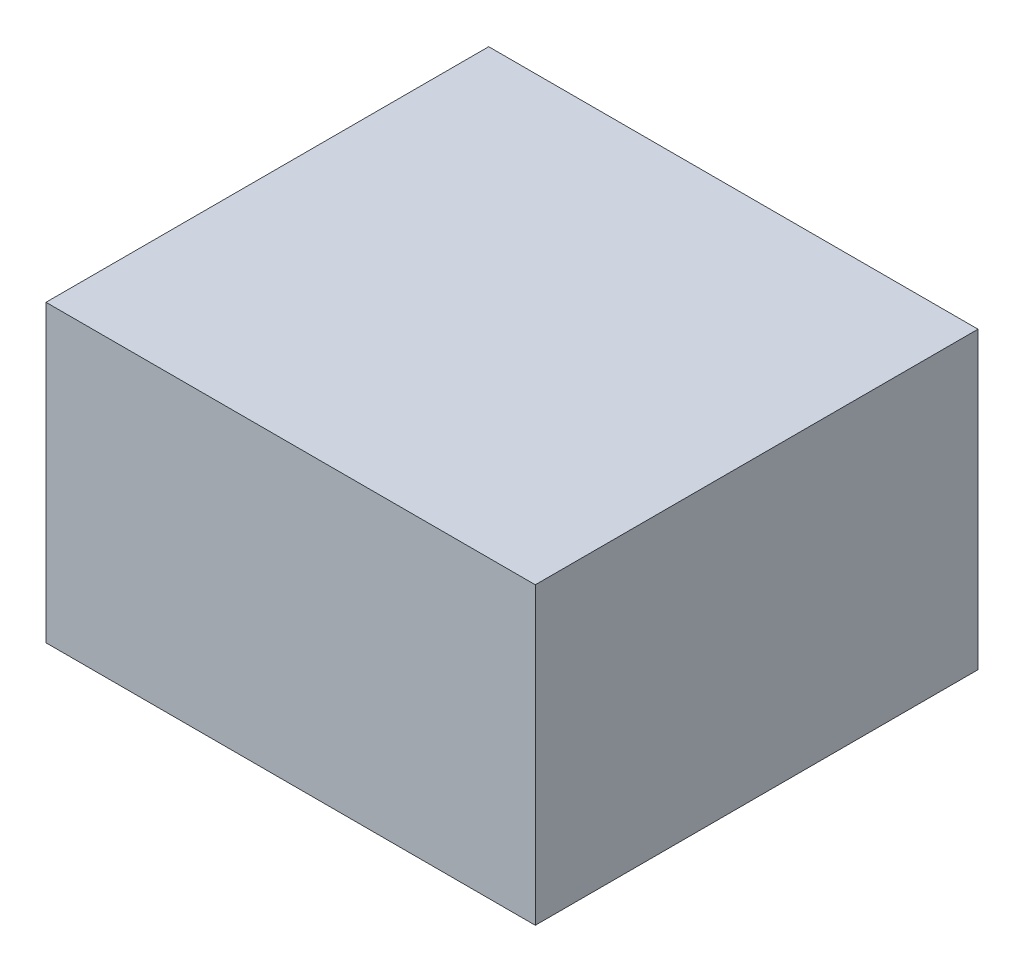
ISO-10303-21;
HEADER;
FILE_DESCRIPTION(('STEP AP214'),'2;1');
FILE_NAME('part.step','',(''),(''),'','','');
FILE_SCHEMA(('AUTOMOTIVE_DESIGN { 1 0 10303 214 1 1 1 1 }'));
ENDSEC;
DATA;
#1=APPLICATION_CONTEXT('core data for automotive mechanical design processes');
#2=APPLICATION_PROTOCOL_DEFINITION('international standard','automotive_design',2000,#1);
#3=PRODUCT_CONTEXT('',#1,'mechanical');
#4=PRODUCT('Part','Part','',(#3));
#5=PRODUCT_RELATED_PRODUCT_CATEGORY('part','',(#4));
#6=PRODUCT_DEFINITION_FORMATION('','',#4);
#7=PRODUCT_DEFINITION_CONTEXT('part definition',#1,'design');
#8=PRODUCT_DEFINITION('design','',#6,#7);
#9=PRODUCT_DEFINITION_SHAPE('','',#8);
#10=(LENGTH_UNIT() NAMED_UNIT(*) SI_UNIT(.MILLI.,.METRE.));
#11=(NAMED_UNIT(*) PLANE_ANGLE_UNIT() SI_UNIT($,.RADIAN.));
#12=(NAMED_UNIT(*) SI_UNIT($,.STERADIAN.) SOLID_ANGLE_UNIT());
#13=UNCERTAINTY_MEASURE_WITH_UNIT(LENGTH_MEASURE(1.E-05),#10,'distance_accuracy_value','');
#14=(GEOMETRIC_REPRESENTATION_CONTEXT(3) GLOBAL_UNCERTAINTY_ASSIGNED_CONTEXT((#13)) GLOBAL_UNIT_ASSIGNED_CONTEXT((#10,
#11,#12)) REPRESENTATION_CONTEXT('',''));
#15=CARTESIAN_POINT('',(0.,0.,0.));
#16=DIRECTION('',(0.,0.,1.));
#17=DIRECTION('',(1.,0.,0.));
#18=AXIS2_PLACEMENT_3D('',#15,#16,#17);
#19=CARTESIAN_POINT('',(-20.1436183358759,-74.4320712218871,21.8817366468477));
#20=DIRECTION('',(1.,0.,0.));
#21=DIRECTION('',(0.,0.,-1.));
#22=AXIS2_PLACEMENT_3D('',#19,#20,#21);
#23=PLANE('',#22);
#24=DIRECTION('',(0.,0.,-1.));
#25=VECTOR('',#24,1.);
#26=CARTESIAN_POINT('',(-20.1436183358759,-44.4320712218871,21.8817366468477));
#27=LINE('',#26,#25);
#28=CARTESIAN_POINT('',(-20.1436183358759,-44.4320712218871,21.8817366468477));
#29=VERTEX_POINT('',#28);
#30=CARTESIAN_POINT('',(-20.1436183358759,-44.4320712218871,-23.1514699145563));
#31=VERTEX_POINT('',#30);
#32=EDGE_CURVE('E124',#29,#31,#27,.T.);
#33=ORIENTED_EDGE('',*,*,#32,.T.);
#34=DIRECTION('',(0.,1.,0.));
#35=VECTOR('',#34,1.);
#36=CARTESIAN_POINT('',(-20.1436183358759,-74.4320712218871,-23.1514699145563));
#37=LINE('',#36,#35);
#38=CARTESIAN_POINT('',(-20.1436183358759,-74.4320712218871,-23.1514699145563));
#39=VERTEX_POINT('',#38);
#40=EDGE_CURVE('E13',#39,#31,#37,.T.);
#41=ORIENTED_EDGE('',*,*,#40,.F.);
#42=DIRECTION('',(0.,0.,-1.));
#43=VECTOR('',#42,1.);
#44=CARTESIAN_POINT('',(-20.1436183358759,-74.4320712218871,21.8817366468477));
#45=LINE('',#44,#43);
#46=CARTESIAN_POINT('',(-20.1436183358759,-74.4320712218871,21.8817366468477));
#47=VERTEX_POINT('',#46);
#48=EDGE_CURVE('E192',#47,#39,#45,.T.);
#49=ORIENTED_EDGE('',*,*,#48,.F.);
#50=DIRECTION('',(0.,1.,0.));
#51=VECTOR('',#50,1.);
#52=CARTESIAN_POINT('',(-20.1436183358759,-74.4320712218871,21.8817366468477));
#53=LINE('',#52,#51);
#54=EDGE_CURVE('E195',#47,#29,#53,.T.);
#55=ORIENTED_EDGE('',*,*,#54,.T.);
#56=EDGE_LOOP('',(#33,#41,#49,#55));
#57=FACE_BOUND('',#56,.T.);
#58=ADVANCED_FACE('F68',(#57),#23,.F.);
#59=CARTESIAN_POINT('',(-20.1436183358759,-74.4320712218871,-23.1514699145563));
#60=DIRECTION('',(0.,0.,1.));
#61=DIRECTION('',(1.,0.,0.));
#62=AXIS2_PLACEMENT_3D('',#59,#60,#61);
#63=PLANE('',#62);
#64=DIRECTION('',(1.,0.,0.));
#65=VECTOR('',#64,1.);
#66=CARTESIAN_POINT('',(-20.1436183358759,-44.4320712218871,-23.1514699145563));
#67=LINE('',#66,#65);
#68=CARTESIAN_POINT('',(29.6299257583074,-44.4320712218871,-23.1514699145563));
#69=VERTEX_POINT('',#68);
#70=EDGE_CURVE('E131',#31,#69,#67,.T.);
#71=ORIENTED_EDGE('',*,*,#70,.T.);
#72=DIRECTION('',(0.,1.,0.));
#73=VECTOR('',#72,1.);
#74=CARTESIAN_POINT('',(29.6299257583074,-74.4320712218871,-23.1514699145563));
#75=LINE('',#74,#73);
#76=CARTESIAN_POINT('',(29.6299257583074,-74.4320712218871,-23.1514699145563));
#77=VERTEX_POINT('',#76);
#78=EDGE_CURVE('E76',#77,#69,#75,.T.);
#79=ORIENTED_EDGE('',*,*,#78,.F.);
#80=DIRECTION('',(1.,0.,0.));
#81=VECTOR('',#80,1.);
#82=CARTESIAN_POINT('',(-20.1436183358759,-74.4320712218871,-23.1514699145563));
#83=LINE('',#82,#81);
#84=EDGE_CURVE('E115',#39,#77,#83,.T.);
#85=ORIENTED_EDGE('',*,*,#84,.F.);
#86=ORIENTED_EDGE('',*,*,#40,.T.);
#87=EDGE_LOOP('',(#71,#79,#85,#86));
#88=FACE_BOUND('',#87,.T.);
#89=ADVANCED_FACE('F179',(#88),#63,.F.);
#90=CARTESIAN_POINT('',(29.6299257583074,-74.4320712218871,21.8817366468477));
#91=DIRECTION('',(-1.,0.,0.));
#92=DIRECTION('',(0.,0.,1.));
#93=AXIS2_PLACEMENT_3D('',#90,#91,#92);
#94=PLANE('',#93);
#95=DIRECTION('',(0.,0.,1.));
#96=VECTOR('',#95,1.);
#97=CARTESIAN_POINT('',(29.6299257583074,-44.4320712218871,21.8817366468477));
#98=LINE('',#97,#96);
#99=CARTESIAN_POINT('',(29.6299257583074,-44.4320712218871,21.8817366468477));
#100=VERTEX_POINT('',#99);
#101=EDGE_CURVE('E102',#69,#100,#98,.T.);
#102=ORIENTED_EDGE('',*,*,#101,.T.);
#103=DIRECTION('',(0.,1.,0.));
#104=VECTOR('',#103,1.);
#105=CARTESIAN_POINT('',(29.6299257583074,-74.4320712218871,21.8817366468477));
#106=LINE('',#105,#104);
#107=CARTESIAN_POINT('',(29.6299257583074,-74.4320712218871,21.8817366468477));
#108=VERTEX_POINT('',#107);
#109=EDGE_CURVE('E190',#108,#100,#106,.T.);
#110=ORIENTED_EDGE('',*,*,#109,.F.);
#111=DIRECTION('',(0.,0.,1.));
#112=VECTOR('',#111,1.);
#113=CARTESIAN_POINT('',(29.6299257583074,-74.4320712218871,21.8817366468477));
#114=LINE('',#113,#112);
#115=EDGE_CURVE('E189',#77,#108,#114,.T.);
#116=ORIENTED_EDGE('',*,*,#115,.F.);
#117=ORIENTED_EDGE('',*,*,#78,.T.);
#118=EDGE_LOOP('',(#102,#110,#116,#117));
#119=FACE_BOUND('',#118,.T.);
#120=ADVANCED_FACE('F177',(#119),#94,.F.);
#121=CARTESIAN_POINT('',(-20.1436183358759,-74.4320712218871,21.8817366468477));
#122=DIRECTION('',(0.,0.,-1.));
#123=DIRECTION('',(-1.,0.,0.));
#124=AXIS2_PLACEMENT_3D('',#121,#122,#123);
#125=PLANE('',#124);
#126=DIRECTION('',(-1.,0.,0.));
#127=VECTOR('',#126,1.);
#128=CARTESIAN_POINT('',(-20.1436183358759,-44.4320712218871,21.8817366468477));
#129=LINE('',#128,#127);
#130=EDGE_CURVE('E108',#100,#29,#129,.T.);
#131=ORIENTED_EDGE('',*,*,#130,.T.);
#132=ORIENTED_EDGE('',*,*,#54,.F.);
#133=DIRECTION('',(-1.,0.,0.));
#134=VECTOR('',#133,1.);
#135=CARTESIAN_POINT('',(-20.1436183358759,-74.4320712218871,21.8817366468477));
#136=LINE('',#135,#134);
#137=EDGE_CURVE('E84',#108,#47,#136,.T.);
#138=ORIENTED_EDGE('',*,*,#137,.F.);
#139=ORIENTED_EDGE('',*,*,#109,.T.);
#140=EDGE_LOOP('',(#131,#132,#138,#139));
#141=FACE_BOUND('',#140,.T.);
#142=ADVANCED_FACE('F170',(#141),#125,.F.);
#143=CARTESIAN_POINT('',(0.,-74.4320712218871,0.));
#144=DIRECTION('',(0.,-1.,0.));
#145=DIRECTION('',(0.,0.,-1.));
#146=AXIS2_PLACEMENT_3D('',#143,#144,#145);
#147=PLANE('',#146);
#148=CARTESIAN_POINT('',(4.98263771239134,-74.4320712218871,-0.75199819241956));
#149=DIRECTION('',(0.,1.,0.));
#150=DIRECTION('',(0.,0.,1.));
#151=AXIS2_PLACEMENT_3D('',#148,#149,#150);
#152=CIRCLE('',#151,20.);
#153=CARTESIAN_POINT('',(4.98263771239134,-74.4320712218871,19.2480018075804));
#154=VERTEX_POINT('',#153);
#155=EDGE_CURVE('E140',#154,#154,#152,.T.);
#156=ORIENTED_EDGE('',*,*,#155,.T.);
#157=EDGE_LOOP('',(#156));
#158=FACE_BOUND('',#157,.T.);
#159=ORIENTED_EDGE('',*,*,#48,.T.);
#160=ORIENTED_EDGE('',*,*,#84,.T.);
#161=ORIENTED_EDGE('',*,*,#115,.T.);
#162=ORIENTED_EDGE('',*,*,#137,.T.);
#163=EDGE_LOOP('',(#159,#160,#161,#162));
#164=FACE_BOUND('',#163,.T.);
#165=ADVANCED_FACE('F167',(#158,#164),#147,.T.);
#166=CARTESIAN_POINT('',(0.,-44.4320712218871,0.));
#167=DIRECTION('',(0.,-1.,0.));
#168=DIRECTION('',(0.,0.,-1.));
#169=AXIS2_PLACEMENT_3D('',#166,#167,#168);
#170=PLANE('',#169);
#171=ORIENTED_EDGE('',*,*,#32,.F.);
#172=ORIENTED_EDGE('',*,*,#130,.F.);
#173=ORIENTED_EDGE('',*,*,#101,.F.);
#174=ORIENTED_EDGE('',*,*,#70,.F.);
#175=EDGE_LOOP('',(#171,#172,#173,#174));
#176=FACE_BOUND('',#175,.T.);
#177=ADVANCED_FACE('F165',(#176),#170,.F.);
#178=CARTESIAN_POINT('',(4.98263771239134,-74.4320712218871,-0.75199819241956));
#179=DIRECTION('',(0.,1.,0.));
#180=DIRECTION('',(0.,0.,1.));
#181=AXIS2_PLACEMENT_3D('',#178,#179,#180);
#182=CYLINDRICAL_SURFACE('',#181,20.);
#183=ORIENTED_EDGE('',*,*,#155,.F.);
#184=EDGE_LOOP('',(#183));
#185=FACE_BOUND('',#184,.T.);
#186=CARTESIAN_POINT('',(4.98263771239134,-64.4320712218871,-0.75199819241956));
#187=DIRECTION('',(0.,1.,0.));
#188=DIRECTION('',(0.,0.,1.));
#189=AXIS2_PLACEMENT_3D('',#186,#187,#188);
#190=CIRCLE('',#189,20.);
#191=CARTESIAN_POINT('',(4.98263771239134,-64.4320712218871,19.2480018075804));
#192=VERTEX_POINT('',#191);
#193=EDGE_CURVE('E202',#192,#192,#190,.F.);
#194=ORIENTED_EDGE('',*,*,#193,.F.);
#195=EDGE_LOOP('',(#194));
#196=FACE_BOUND('',#195,.T.);
#197=ADVANCED_FACE('F158',(#185,#196),#182,.F.);
#198=CARTESIAN_POINT('',(4.98263771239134,-64.8820712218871,-0.75199819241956));
#199=DIRECTION('',(0.,-1.,0.));
#200=DIRECTION('',(-1.,0.,0.));
#201=AXIS2_PLACEMENT_3D('',#198,#199,#200);
#202=SPHERICAL_SURFACE('',#201,10.58);
#203=CARTESIAN_POINT('',(4.98263771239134,-61.4320712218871,-0.75199819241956));
#204=DIRECTION('',(0.,-1.,0.));
#205=DIRECTION('',(0.,0.,-1.));
#206=AXIS2_PLACEMENT_3D('',#203,#204,#205);
#207=CIRCLE('',#206,10.0016948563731);
#208=CARTESIAN_POINT('',(4.98263771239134,-61.4320712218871,-10.7536930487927));
#209=VERTEX_POINT('',#208);
#210=EDGE_CURVE('E134',#209,#209,#207,.T.);
#211=ORIENTED_EDGE('',*,*,#210,.T.);
#212=EDGE_LOOP('',(#211));
#213=FACE_BOUND('',#212,.T.);
#214=ADVANCED_FACE('F154',(#213),#202,.F.);
#215=CARTESIAN_POINT('',(4.98263771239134,-61.4320712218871,-0.75199819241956));
#216=DIRECTION('',(0.,1.,0.));
#217=DIRECTION('',(0.,0.,1.));
#218=AXIS2_PLACEMENT_3D('',#215,#216,#217);
#219=CONICAL_SURFACE('',#218,10.0016948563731,0.000564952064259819);
#220=CARTESIAN_POINT('',(4.98263771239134,-64.4320712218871,-0.75199819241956));
#221=DIRECTION('',(0.,-1.,0.));
#222=DIRECTION('',(0.,0.,-1.));
#223=AXIS2_PLACEMENT_3D('',#220,#221,#222);
#224=CIRCLE('',#223,10.);
#225=CARTESIAN_POINT('',(4.98263771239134,-64.4320712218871,-10.7519981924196));
#226=VERTEX_POINT('',#225);
#227=EDGE_CURVE('E125',#226,#226,#224,.T.);
#228=ORIENTED_EDGE('',*,*,#227,.T.);
#229=EDGE_LOOP('',(#228));
#230=FACE_BOUND('',#229,.T.);
#231=ORIENTED_EDGE('',*,*,#210,.F.);
#232=EDGE_LOOP('',(#231));
#233=FACE_BOUND('',#232,.T.);
#234=ADVANCED_FACE('F151',(#230,#233),#219,.F.);
#235=CARTESIAN_POINT('',(14.9826377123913,-64.4320712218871,-0.75199819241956));
#236=DIRECTION('',(0.,-1.,0.));
#237=DIRECTION('',(0.,0.,-1.));
#238=AXIS2_PLACEMENT_3D('',#235,#236,#237);
#239=PLANE('',#238);
#240=CARTESIAN_POINT('',(4.98263771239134,-64.4320712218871,-15.7519981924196));
#241=CARTESIAN_POINT('',(5.23015977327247,-64.4320712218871,-15.7520172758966));
#242=CARTESIAN_POINT('',(5.47769463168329,-64.4320712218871,-15.7461041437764));
#243=CARTESIAN_POINT('',(5.97039914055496,-64.4320712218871,-15.7222967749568));
#244=CARTESIAN_POINT('',(6.2155729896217,-64.4320712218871,-15.7044890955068));
#245=CARTESIAN_POINT('',(6.70355866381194,-64.4320712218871,-15.6568972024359));
#246=CARTESIAN_POINT('',(6.94637617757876,-64.4320712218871,-15.6271715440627));
#247=CARTESIAN_POINT('',(7.42964622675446,-64.4320712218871,-15.5557786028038));
#248=CARTESIAN_POINT('',(7.67010307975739,-64.4320712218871,-15.5141405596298));
#249=CARTESIAN_POINT('',(8.14865421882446,-64.4320712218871,-15.4189509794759));
#250=CARTESIAN_POINT('',(8.3867484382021,-64.4320712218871,-15.3653991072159));
#251=CARTESIAN_POINT('',(8.86057906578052,-64.4320712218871,-15.2464122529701));
#252=CARTESIAN_POINT('',(9.09630810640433,-64.4320712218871,-15.1809479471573));
#253=CARTESIAN_POINT('',(9.56541643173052,-64.4320712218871,-15.0381642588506));
#254=CARTESIAN_POINT('',(9.79877839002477,-64.4320712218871,-14.9607879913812));
#255=CARTESIAN_POINT('',(10.2631622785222,-64.4320712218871,-14.7942102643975));
#256=CARTESIAN_POINT('',(10.494154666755,-64.4320712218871,-14.7049265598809));
#257=CARTESIAN_POINT('',(10.9515588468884,-64.4320712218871,-14.515482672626));
#258=CARTESIAN_POINT('',(11.1779719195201,-64.4320712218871,-14.4153255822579));
#259=CARTESIAN_POINT('',(11.6240318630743,-64.4320712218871,-14.2048220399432));
#260=CARTESIAN_POINT('',(11.8437156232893,-64.4320712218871,-14.0945538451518));
#261=CARTESIAN_POINT('',(12.2763230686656,-64.4320712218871,-13.8638572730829));
#262=CARTESIAN_POINT('',(12.4892742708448,-64.4320712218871,-13.7434805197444));
#263=CARTESIAN_POINT('',(12.9084268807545,-64.4320712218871,-13.4925933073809));
#264=CARTESIAN_POINT('',(13.1146432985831,-64.4320712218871,-13.3621079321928));
#265=CARTESIAN_POINT('',(13.5203394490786,-64.4320712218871,-13.0910303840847));
#266=CARTESIAN_POINT('',(13.7198188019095,-64.4320712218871,-12.9504376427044));
#267=CARTESIAN_POINT('',(14.1120568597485,-64.4320712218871,-12.6591711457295));
#268=CARTESIAN_POINT('',(14.3047973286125,-64.4320712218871,-12.5084728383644));
#269=CARTESIAN_POINT('',(14.6835757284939,-64.4320712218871,-12.1970180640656));
#270=CARTESIAN_POINT('',(14.8695756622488,-64.4320712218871,-12.0362154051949));
#271=CARTESIAN_POINT('',(15.2348937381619,-64.4320712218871,-11.7045760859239));
#272=CARTESIAN_POINT('',(15.4141528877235,-64.4320712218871,-11.5336744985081));
#273=CARTESIAN_POINT('',(15.7642589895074,-64.4320712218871,-11.1835923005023));
#274=CARTESIAN_POINT('',(15.9351091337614,-64.4320712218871,-11.0044148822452));
#275=CARTESIAN_POINT('',(16.2666587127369,-64.4320712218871,-10.6392353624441));
#276=CARTESIAN_POINT('',(16.4274221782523,-64.4320712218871,-10.453291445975));
#277=CARTESIAN_POINT('',(16.7388155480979,-64.4320712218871,-10.0746038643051));
#278=CARTESIAN_POINT('',(16.8894906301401,-64.4320712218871,-9.88189736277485));
#279=CARTESIAN_POINT('',(17.1807267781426,-64.4320712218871,-9.48970505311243));
#280=CARTESIAN_POINT('',(17.3213113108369,-64.4320712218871,-9.29023667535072));
#281=CARTESIAN_POINT('',(17.5923887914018,-64.4320712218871,-8.88454047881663));
#282=CARTESIAN_POINT('',(17.7228811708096,-64.4320712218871,-8.6783122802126));
#283=CARTESIAN_POINT('',(17.973799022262,-64.4320712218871,-8.2591141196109));
#284=CARTESIAN_POINT('',(18.0941982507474,-64.4320712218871,-8.04612845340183));
#285=CARTESIAN_POINT('',(18.3249552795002,-64.4320712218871,-7.61342954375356));
#286=CARTESIAN_POINT('',(18.4352602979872,-64.4320712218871,-7.39368816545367));
#287=CARTESIAN_POINT('',(18.6458573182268,-64.4320712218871,-6.94749221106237));
#288=CARTESIAN_POINT('',(18.7460699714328,-64.4320712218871,-6.72100022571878));
#289=CARTESIAN_POINT('',(18.9355551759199,-64.4320712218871,-6.26358664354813));
#290=CARTESIAN_POINT('',(19.0248318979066,-64.4320712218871,-6.03266677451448));
#291=CARTESIAN_POINT('',(19.191395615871,-64.4320712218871,-5.56840635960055));
#292=CARTESIAN_POINT('',(19.2687640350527,-64.4320712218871,-5.33509506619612));
#293=CARTESIAN_POINT('',(19.4115365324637,-64.4320712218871,-4.86606827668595));
#294=CARTESIAN_POINT('',(19.4769965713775,-64.4320712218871,-4.63036982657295));
#295=CARTESIAN_POINT('',(19.5959781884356,-64.4320712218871,-4.15658013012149));
#296=CARTESIAN_POINT('',(19.6495281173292,-64.4320712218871,-3.91849600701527));
#297=CARTESIAN_POINT('',(19.7447178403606,-64.4320712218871,-3.43994473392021));
#298=CARTESIAN_POINT('',(19.786356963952,-64.4320712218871,-3.19947745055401));
#299=CARTESIAN_POINT('',(19.8577546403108,-64.4320712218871,-2.71616674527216));
#300=CARTESIAN_POINT('',(19.8874829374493,-64.4320712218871,-2.47331885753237));
#301=CARTESIAN_POINT('',(19.9350879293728,-64.4320712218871,-1.98525029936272));
#302=CARTESIAN_POINT('',(19.9529050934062,-64.4320712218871,-1.74002383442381));
#303=CARTESIAN_POINT('',(19.9767195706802,-64.4320712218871,-1.24720053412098));
#304=CARTESIAN_POINT('',(19.982629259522,-64.4320712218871,-0.999599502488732));
#305=CARTESIAN_POINT('',(19.9826461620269,-64.4320712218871,-0.504491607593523));
#306=CARTESIAN_POINT('',(19.9767578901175,-64.4320712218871,-0.256984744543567));
#307=CARTESIAN_POINT('',(19.952977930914,-64.4320712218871,0.23567712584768));
#308=CARTESIAN_POINT('',(19.9351726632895,-64.4320712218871,0.480836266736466));
#309=CARTESIAN_POINT('',(19.8875884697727,-64.4320712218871,0.968797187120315));
#310=CARTESIAN_POINT('',(19.8578677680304,-64.4320712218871,1.21160463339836));
#311=CARTESIAN_POINT('',(19.7864809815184,-64.4320712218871,1.6948615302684));
#312=CARTESIAN_POINT('',(19.7448438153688,-64.4320712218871,1.93531524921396));
#313=CARTESIAN_POINT('',(19.6496540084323,-64.4320712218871,2.41386650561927));
#314=CARTESIAN_POINT('',(19.5961006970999,-64.4320712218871,2.65196390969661));
#315=CARTESIAN_POINT('',(19.4771085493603,-64.4320712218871,3.1258074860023));
#316=CARTESIAN_POINT('',(19.4116400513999,-64.4320712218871,3.36154620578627));
#317=CARTESIAN_POINT('',(19.268845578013,-64.4320712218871,3.8306803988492));
#318=CARTESIAN_POINT('',(19.1914623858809,-64.4320712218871,4.06405844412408));
#319=CARTESIAN_POINT('',(19.0248687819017,-64.4320712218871,4.52848121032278));
#320=CARTESIAN_POINT('',(18.9355758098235,-64.4320712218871,4.75949627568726));
#321=CARTESIAN_POINT('',(18.7461218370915,-64.4320712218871,5.21692279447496));
#322=CARTESIAN_POINT('',(18.6459650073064,-64.4320712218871,5.443335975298));
#323=CARTESIAN_POINT('',(18.4354616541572,-64.4320712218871,5.88939599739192));
#324=CARTESIAN_POINT('',(18.3251933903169,-64.4320712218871,6.10907972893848));
#325=CARTESIAN_POINT('',(18.0944967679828,-64.4320712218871,6.54168715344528));
#326=CARTESIAN_POINT('',(17.9741200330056,-64.4320712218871,6.75463836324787));
#327=CARTESIAN_POINT('',(17.723232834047,-64.4320712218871,7.17379097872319));
#328=CARTESIAN_POINT('',(17.5927474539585,-64.4320712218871,7.38000739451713));
#329=CARTESIAN_POINT('',(17.3216699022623,-64.4320712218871,7.78570354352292));
#330=CARTESIAN_POINT('',(17.1810771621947,-64.4320712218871,7.98518289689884));
#331=CARTESIAN_POINT('',(16.8898106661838,-64.4320712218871,8.37742095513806));
#332=CARTESIAN_POINT('',(16.7391123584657,-64.4320712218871,8.57016142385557));
#333=CARTESIAN_POINT('',(16.4276575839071,-64.4320712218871,8.94893982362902));
#334=CARTESIAN_POINT('',(16.2668549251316,-64.4320712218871,9.13493975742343));
#335=CARTESIAN_POINT('',(15.9352156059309,-64.4320712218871,9.50025783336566));
#336=CARTESIAN_POINT('',(15.7643140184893,-64.4320712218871,9.67951698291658));
#337=CARTESIAN_POINT('',(15.414231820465,-64.4320712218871,10.0296230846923));
#338=CARTESIAN_POINT('',(15.2350544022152,-64.4320712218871,10.2004732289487));
#339=CARTESIAN_POINT('',(14.8698748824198,-64.4320712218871,10.5320228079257));
#340=CARTESIAN_POINT('',(14.6839309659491,-64.4320712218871,10.6927862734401));
#341=CARTESIAN_POINT('',(14.3052433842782,-64.4320712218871,11.0041796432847));
#342=CARTESIAN_POINT('',(14.1125368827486,-64.4320712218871,11.154854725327));
#343=CARTESIAN_POINT('',(13.7203445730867,-64.4320712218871,11.4460908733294));
#344=CARTESIAN_POINT('',(13.520876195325,-64.4320712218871,11.5866754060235));
#345=CARTESIAN_POINT('',(13.1151799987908,-64.4320712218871,11.8577528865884));
#346=CARTESIAN_POINT('',(12.9089518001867,-64.4320712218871,11.9882452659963));
#347=CARTESIAN_POINT('',(12.4897536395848,-64.4320712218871,12.239163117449));
#348=CARTESIAN_POINT('',(12.2767679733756,-64.4320712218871,12.3595623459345));
#349=CARTESIAN_POINT('',(11.8440690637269,-64.4320712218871,12.5903193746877));
#350=CARTESIAN_POINT('',(11.6243276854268,-64.4320712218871,12.700624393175));
#351=CARTESIAN_POINT('',(11.1781317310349,-64.4320712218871,12.9112214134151));
#352=CARTESIAN_POINT('',(10.9516397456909,-64.4320712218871,13.0114340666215));
#353=CARTESIAN_POINT('',(10.4942261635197,-64.4320712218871,13.2009192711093));
#354=CARTESIAN_POINT('',(10.2633062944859,-64.4320712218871,13.2901959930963));
#355=CARTESIAN_POINT('',(9.79904587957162,-64.4320712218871,13.4567597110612));
#356=CARTESIAN_POINT('',(9.56573458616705,-64.4320712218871,13.5341281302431));
#357=CARTESIAN_POINT('',(9.09670779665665,-64.4320712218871,13.6769006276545));
#358=CARTESIAN_POINT('',(8.86100934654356,-64.4320712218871,13.7423606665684));
#359=CARTESIAN_POINT('',(8.387219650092,-64.4320712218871,13.8613422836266));
#360=CARTESIAN_POINT('',(8.14913552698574,-64.4320712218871,13.9148922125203));
#361=CARTESIAN_POINT('',(7.67058425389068,-64.4320712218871,14.0100819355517));
#362=CARTESIAN_POINT('',(7.43011697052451,-64.4320712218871,14.0517210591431));
#363=CARTESIAN_POINT('',(6.94680626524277,-64.4320712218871,14.1231187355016));
#364=CARTESIAN_POINT('',(6.70395837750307,-64.4320712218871,14.15284703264));
#365=CARTESIAN_POINT('',(6.21588981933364,-64.4320712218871,14.2004520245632));
#366=CARTESIAN_POINT('',(5.97066335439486,-64.4320712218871,14.2182691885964));
#367=CARTESIAN_POINT('',(5.47784005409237,-64.4320712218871,14.24208366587));
#368=CARTESIAN_POINT('',(5.23023902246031,-64.4320712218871,14.2479933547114));
#369=CARTESIAN_POINT('',(4.73513112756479,-64.4320712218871,14.2480102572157));
#370=CARTESIAN_POINT('',(4.48762426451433,-64.4320712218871,14.2421219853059));
#371=CARTESIAN_POINT('',(3.99496239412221,-64.4320712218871,14.218342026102));
#372=CARTESIAN_POINT('',(3.74980325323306,-64.4320712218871,14.2005367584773));
#373=CARTESIAN_POINT('',(3.26184233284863,-64.4320712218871,14.1529525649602));
#374=CARTESIAN_POINT('',(3.01903488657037,-64.4320712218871,14.1232318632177));
#375=CARTESIAN_POINT('',(2.53577798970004,-64.4320712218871,14.0518450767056));
#376=CARTESIAN_POINT('',(2.29532427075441,-64.4320712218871,14.0102079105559));
#377=CARTESIAN_POINT('',(1.8167730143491,-64.4320712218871,13.9150181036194));
#378=CARTESIAN_POINT('',(1.57867561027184,-64.4320712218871,13.8614647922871));
#379=CARTESIAN_POINT('',(1.10483203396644,-64.4320712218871,13.7424726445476));
#380=CARTESIAN_POINT('',(0.869093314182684,-64.4320712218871,13.6770041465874));
#381=CARTESIAN_POINT('',(0.399959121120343,-64.4320712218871,13.5342096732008));
#382=CARTESIAN_POINT('',(0.16658107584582,-64.4320712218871,13.4568264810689));
#383=CARTESIAN_POINT('',(-0.297841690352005,-64.4320712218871,13.2902328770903));
#384=CARTESIAN_POINT('',(-0.528856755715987,-64.4320712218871,13.2009399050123));
#385=CARTESIAN_POINT('',(-0.986283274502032,-64.4320712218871,13.0114859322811));
#386=CARTESIAN_POINT('',(-1.21269645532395,-64.4320712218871,12.9113291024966));
#387=CARTESIAN_POINT('',(-1.65875647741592,-64.4320712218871,12.7008257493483));
#388=CARTESIAN_POINT('',(-1.87844020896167,-64.4320712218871,12.5905574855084));
#389=CARTESIAN_POINT('',(-2.31104763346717,-64.4320712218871,12.359860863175));
#390=CARTESIAN_POINT('',(-2.52399884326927,-64.4320712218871,12.2394841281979));
#391=CARTESIAN_POINT('',(-2.94315145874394,-64.4320712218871,11.9885969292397));
#392=CARTESIAN_POINT('',(-3.14936787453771,-64.4320712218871,11.8581115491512));
#393=CARTESIAN_POINT('',(-3.5550640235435,-64.4320712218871,11.5870339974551));
#394=CARTESIAN_POINT('',(-3.75454337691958,-64.4320712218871,11.4464412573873));
#395=CARTESIAN_POINT('',(-4.14678143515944,-64.4320712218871,11.1551747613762));
#396=CARTESIAN_POINT('',(-4.33952190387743,-64.4320712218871,11.0044764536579));
#397=CARTESIAN_POINT('',(-4.71830030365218,-64.4320712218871,10.6930216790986));
#398=CARTESIAN_POINT('',(-4.90430023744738,-64.4320712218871,10.5322190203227));
#399=CARTESIAN_POINT('',(-5.26961831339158,-64.4320712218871,10.2005797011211));
#400=CARTESIAN_POINT('',(-5.44887746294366,-64.4320712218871,10.029678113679));
#401=CARTESIAN_POINT('',(-5.79898356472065,-64.4320712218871,9.67959591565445));
#402=CARTESIAN_POINT('',(-5.96983370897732,-64.4320712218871,9.50041849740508));
#403=CARTESIAN_POINT('',(-6.30138328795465,-64.4320712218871,9.13523897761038));
#404=CARTESIAN_POINT('',(-6.46214675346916,-64.4320712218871,8.94929506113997));
#405=CARTESIAN_POINT('',(-6.77354012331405,-64.4320712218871,8.57060747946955));
#406=CARTESIAN_POINT('',(-6.92421520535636,-64.4320712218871,8.37790097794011));
#407=CARTESIAN_POINT('',(-7.21545135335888,-64.4320712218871,7.98570866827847));
#408=CARTESIAN_POINT('',(-7.35603588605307,-64.4320712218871,7.78624029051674));
#409=CARTESIAN_POINT('',(-7.62711336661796,-64.4320712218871,7.38054409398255));
#410=CARTESIAN_POINT('',(-7.7576057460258,-64.4320712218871,7.17431589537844));
#411=CARTESIAN_POINT('',(-8.00852359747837,-64.4320712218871,6.75511773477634));
#412=CARTESIAN_POINT('',(-8.12892282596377,-64.4320712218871,6.54213206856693));
#413=CARTESIAN_POINT('',(-8.35967985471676,-64.4320712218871,6.1094331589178));
#414=CARTESIAN_POINT('',(-8.46998487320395,-64.4320712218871,5.88969178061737));
#415=CARTESIAN_POINT('',(-8.68058189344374,-64.4320712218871,5.44349582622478));
#416=CARTESIAN_POINT('',(-8.78079454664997,-64.4320712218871,5.21700384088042));
#417=CARTESIAN_POINT('',(-8.97027975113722,-64.4320712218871,4.75959025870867));
#418=CARTESIAN_POINT('',(-9.0595564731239,-64.4320712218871,4.52867038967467));
#419=CARTESIAN_POINT('',(-9.22612019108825,-64.4320712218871,4.06440997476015));
#420=CARTESIAN_POINT('',(-9.30348861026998,-64.4320712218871,3.83109868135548));
#421=CARTESIAN_POINT('',(-9.44626110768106,-64.4320712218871,3.36207189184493));
#422=CARTESIAN_POINT('',(-9.51172114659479,-64.4320712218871,3.12637344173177));
#423=CARTESIAN_POINT('',(-9.63070276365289,-64.4320712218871,2.65258374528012));
#424=CARTESIAN_POINT('',(-9.68425269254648,-64.4320712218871,2.41449962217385));
#425=CARTESIAN_POINT('',(-9.77944241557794,-64.4320712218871,1.93594834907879));
#426=CARTESIAN_POINT('',(-9.82108153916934,-64.4320712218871,1.69548106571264));
#427=CARTESIAN_POINT('',(-9.89247921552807,-64.4320712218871,1.21217036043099));
#428=CARTESIAN_POINT('',(-9.92220751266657,-64.4320712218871,0.969322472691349));
#429=CARTESIAN_POINT('',(-9.9698125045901,-64.4320712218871,0.48125391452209));
#430=CARTESIAN_POINT('',(-9.98762966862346,-64.4320712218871,0.236027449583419));
#431=CARTESIAN_POINT('',(-10.0114441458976,-64.4320712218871,-0.25679585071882));
#432=CARTESIAN_POINT('',(-10.0173538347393,-64.4320712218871,-0.504396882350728));
#433=CARTESIAN_POINT('',(-10.0173707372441,-64.4320712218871,-0.999504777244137));
#434=CARTESIAN_POINT('',(-10.0114824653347,-64.4320712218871,-1.24701164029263));
#435=CARTESIAN_POINT('',(-9.98770250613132,-64.4320712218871,-1.73967351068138));
#436=CARTESIAN_POINT('',(-9.96989723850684,-64.4320712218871,-1.98483265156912));
#437=CARTESIAN_POINT('',(-9.92231304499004,-64.4320712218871,-2.47279357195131));
#438=CARTESIAN_POINT('',(-9.89259234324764,-64.4320712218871,-2.71560101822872));
#439=CARTESIAN_POINT('',(-9.82120555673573,-64.4320712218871,-3.19885791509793));
#440=CARTESIAN_POINT('',(-9.77956839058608,-64.4320712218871,-3.43931163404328));
#441=CARTESIAN_POINT('',(-9.68437858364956,-64.4320712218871,-3.91786289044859));
#442=CARTESIAN_POINT('',(-9.63082527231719,-64.4320712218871,-4.15596029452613));
#443=CARTESIAN_POINT('',(-9.51183312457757,-64.4320712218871,-4.62980387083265));
#444=CARTESIAN_POINT('',(-9.44636462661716,-64.4320712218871,-4.86554259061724));
#445=CARTESIAN_POINT('',(-9.30357015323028,-64.4320712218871,-5.33467678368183));
#446=CARTESIAN_POINT('',(-9.22618696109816,-64.4320712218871,-5.56805482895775));
#447=CARTESIAN_POINT('',(-9.05959335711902,-64.4320712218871,-6.03247759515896));
#448=CARTESIAN_POINT('',(-8.97030038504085,-64.4320712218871,-6.26349266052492));
#449=CARTESIAN_POINT('',(-8.78084641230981,-64.4320712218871,-6.72091917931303));
#450=CARTESIAN_POINT('',(-8.6806895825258,-64.4320712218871,-6.94733236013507));
#451=CARTESIAN_POINT('',(-8.47018622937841,-64.4320712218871,-7.39339238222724));
#452=CARTESIAN_POINT('',(-8.35991796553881,-64.4320712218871,-7.61307611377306));
#453=CARTESIAN_POINT('',(-8.12922134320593,-64.4320712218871,-8.04568353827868));
#454=CARTESIAN_POINT('',(-8.00884460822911,-64.4320712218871,-8.25863474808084));
#455=CARTESIAN_POINT('',(-7.75795740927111,-64.4320712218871,-8.67778736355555));
#456=CARTESIAN_POINT('',(-7.62747202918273,-64.4320712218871,-8.88400377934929));
#457=CARTESIAN_POINT('',(-7.35639447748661,-64.4320712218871,-9.28969992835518));
#458=CARTESIAN_POINT('',(-7.21580173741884,-64.4320712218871,-9.48917928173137));
#459=CARTESIAN_POINT('',(-6.92453524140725,-64.4320712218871,-9.88141733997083));
#460=CARTESIAN_POINT('',(-6.77383693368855,-64.4320712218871,-10.0741578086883));
#461=CARTESIAN_POINT('',(-6.46238215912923,-64.4320712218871,-10.4529362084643));
#462=CARTESIAN_POINT('',(-6.30157950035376,-64.4320712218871,-10.6389361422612));
#463=CARTESIAN_POINT('',(-5.96994018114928,-64.4320712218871,-11.0042542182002));
#464=CARTESIAN_POINT('',(-5.79903859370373,-64.4320712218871,-11.1835133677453));
#465=CARTESIAN_POINT('',(-5.44895639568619,-64.4320712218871,-11.5336194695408));
#466=CARTESIAN_POINT('',(-5.26977897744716,-64.4320712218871,-11.704469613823));
#467=CARTESIAN_POINT('',(-4.90459945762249,-64.4320712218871,-12.0360191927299));
#468=CARTESIAN_POINT('',(-4.71865554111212,-64.4320712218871,-12.1967826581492));
#469=CARTESIAN_POINT('',(-4.33996795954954,-64.4320712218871,-12.5081760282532));
#470=CARTESIAN_POINT('',(-4.147261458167,-64.4320712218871,-12.6588511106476));
#471=CARTESIAN_POINT('',(-3.75506914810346,-64.4320712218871,-12.9500872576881));
#472=CARTESIAN_POINT('',(-3.5556007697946,-64.4320712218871,-13.0906717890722));
#473=CARTESIAN_POINT('',(-3.1499045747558,-64.4320712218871,-13.3617492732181));
#474=CARTESIAN_POINT('',(-2.94367637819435,-64.4320712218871,-13.4922416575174));
#475=CARTESIAN_POINT('',(-2.52447821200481,-64.4320712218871,-13.7431594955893));
#476=CARTESIAN_POINT('',(-2.31149253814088,-64.4320712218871,-13.8635587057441));
#477=CARTESIAN_POINT('',(-1.87879364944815,-64.4320712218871,-14.0943157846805));
#478=CARTESIAN_POINT('',(-1.65905229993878,-64.4320712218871,-14.2046208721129));
#479=CARTESIAN_POINT('',(-1.2128562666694,-64.4320712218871,-14.4152177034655));
#480=CARTESIAN_POINT('',(-0.986364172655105,-64.4320712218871,-14.5154300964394));
#481=CARTESIAN_POINT('',(-0.528928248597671,-64.4320712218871,-14.7049253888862));
#482=CARTESIAN_POINT('',(-0.297985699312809,-64.4320712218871,-14.7942113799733));
#483=CARTESIAN_POINT('',(0.166313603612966,-64.4320712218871,-14.9607909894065));
#484=CARTESIAN_POINT('',(0.399640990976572,-64.4320712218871,-15.0381663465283));
#485=CARTESIAN_POINT('',(0.868693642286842,-64.4320712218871,-15.1809496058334));
#486=CARTESIAN_POINT('',(1.10440175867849,-64.4320712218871,-15.2464138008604));
#487=CARTESIAN_POINT('',(1.57820444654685,-64.4320712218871,-15.3654008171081));
#488=CARTESIAN_POINT('',(1.81629180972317,-64.4320712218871,-15.4189523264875));
#489=CARTESIAN_POINT('',(2.29484305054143,-64.4320712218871,-15.5141418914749));
#490=CARTESIAN_POINT('',(2.53530699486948,-64.4320712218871,-15.5557796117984));
#491=CARTESIAN_POINT('',(3.01860510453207,-64.4320712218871,-15.6271725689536));
#492=CARTESIAN_POINT('',(3.26144368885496,-64.4320712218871,-15.6568978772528));
#493=CARTESIAN_POINT('',(3.7494853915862,-64.4320712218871,-15.7044897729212));
#494=CARTESIAN_POINT('',(3.99469426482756,-64.4320712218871,-15.7222971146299));
#495=CARTESIAN_POINT('',(4.48748281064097,-64.4320712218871,-15.7461044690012));
#496=CARTESIAN_POINT('',(4.73506671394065,-64.4320712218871,-15.7520172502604));
#497=CARTESIAN_POINT('',(4.98263771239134,-64.4320712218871,-15.7519981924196));
#498=B_SPLINE_CURVE_WITH_KNOTS('',3,(#240,#241,#242,#243,#244,#245,#246,#247,#248,#249,#250,
#251,#252,#253,#254,#255,#256,#257,#258,#259,#260,#261,#262,#263,#264,#265,#266,#267,#268,#269,
#270,#271,#272,#273,#274,#275,#276,#277,#278,#279,#280,#281,#282,#283,#284,#285,#286,#287,#288,
#289,#290,#291,#292,#293,#294,#295,#296,#297,#298,#299,#300,#301,#302,#303,#304,#305,#306,#307,
#308,#309,#310,#311,#312,#313,#314,#315,#316,#317,#318,#319,#320,#321,#322,#323,#324,#325,#326,
#327,#328,#329,#330,#331,#332,#333,#334,#335,#336,#337,#338,#339,#340,#341,#342,#343,#344,#345,
#346,#347,#348,#349,#350,#351,#352,#353,#354,#355,#356,#357,#358,#359,#360,#361,#362,#363,#364,
#365,#366,#367,#368,#369,#370,#371,#372,#373,#374,#375,#376,#377,#378,#379,#380,#381,#382,#383,
#384,#385,#386,#387,#388,#389,#390,#391,#392,#393,#394,#395,#396,#397,#398,#399,#400,#401,#402,
#403,#404,#405,#406,#407,#408,#409,#410,#411,#412,#413,#414,#415,#416,#417,#418,#419,#420,#421,
#422,#423,#424,#425,#426,#427,#428,#429,#430,#431,#432,#433,#434,#435,#436,#437,#438,#439,#440,
#441,#442,#443,#444,#445,#446,#447,#448,#449,#450,#451,#452,#453,#454,#455,#456,#457,#458,#459,
#460,#461,#462,#463,#464,#465,#466,#467,#468,#469,#470,#471,#472,#473,#474,#475,#476,#477,#478,
#479,#480,#481,#482,#483,#484,#485,#486,#487,#488,#489,#490,#491,#492,#493,#494,#495,#496,#497),
.UNSPECIFIED.,.F.,.F.,(4,2,2,2,2,2,2,2,2,2,2,2,2,2,2,2,2,2,2,2,2,2,2,2,2,2,2,2,2,2,2,2,2,2,2,2,
2,2,2,2,2,2,2,2,2,2,2,2,2,2,2,2,2,2,2,2,2,2,2,2,2,2,2,2,2,2,2,2,2,2,2,2,2,2,2,2,2,2,2,2,2,2,2,2,
2,2,2,2,2,2,2,2,2,2,2,2,2,2,2,2,2,2,2,2,2,2,2,2,2,2,2,2,2,2,2,2,2,2,2,2,2,2,2,2,2,2,2,2,4),(0.,
0.742513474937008,1.47968166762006,2.21327155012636,2.94507601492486,3.67690107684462,
4.4105525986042,5.14782302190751,5.8904785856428,6.63292349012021,7.37004184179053,
8.10360136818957,8.8353955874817,9.56723099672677,10.3009137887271,11.038236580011,
11.7809656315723,12.5234105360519,13.2605288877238,13.9940884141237,14.7258826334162,
15.4577180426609,16.1914008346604,16.9287236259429,17.6714526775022,18.4138975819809,
19.1510159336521,19.8845754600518,20.6163696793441,21.3482050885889,22.0818878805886,
22.8192106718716,23.5619397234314,24.3043846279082,25.0415029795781,25.7750625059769,
26.5068567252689,27.2386921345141,27.9723749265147,28.7096977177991,29.4524267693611,
30.1948716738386,30.931990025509,31.6655495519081,32.3973437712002,33.1291791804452,
33.8628619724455,34.6001847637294,35.3429138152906,36.0853587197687,36.8224770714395,
37.5560365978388,38.287830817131,39.019666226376,39.753349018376,40.4906718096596,
41.2334008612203,41.9758457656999,42.7129641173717,43.4465236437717,44.1783178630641,
44.9101532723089,45.6438360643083,46.3811588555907,47.1238879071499,47.8663328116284,
48.6034511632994,49.3370106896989,50.0688049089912,50.8006403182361,51.5343231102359,
52.2716459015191,53.0143749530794,53.7568198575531,54.4939382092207,55.2274977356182,
55.9592919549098,56.6911273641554,57.4248101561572,58.1621329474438,58.9048619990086,
59.6473069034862,60.3844252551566,61.1179847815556,61.8497790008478,62.5816144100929,
63.3152972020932,64.0526199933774,64.795349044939,65.5377939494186,66.2749123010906,
67.0084718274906,67.7402660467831,68.4721014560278,69.205784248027,69.9431070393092,
70.685836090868,71.4282809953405,72.1653993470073,72.8989588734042,73.6307530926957,
74.3625885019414,75.0962712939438,75.8335940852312,76.5763231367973,77.3187680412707,
78.0558863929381,78.7894459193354,79.5212401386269,80.2530755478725,80.9867583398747,
81.7240811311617,82.4668101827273,83.2092550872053,83.9463734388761,84.6799329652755,
85.4117271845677,86.1435625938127,86.8772453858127,87.6145681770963,88.357297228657,
89.0998156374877,89.8369863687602,90.5705771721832,91.3023817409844,92.0342069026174,
92.7678593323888,93.5051322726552,94.2477927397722),.UNSPECIFIED.);
#499=CARTESIAN_POINT('',(4.98263771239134,-64.4320712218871,-15.7519981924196));
#500=VERTEX_POINT('',#499);
#501=EDGE_CURVE('E120',#500,#500,#498,.T.);
#502=ORIENTED_EDGE('',*,*,#501,.T.);
#503=EDGE_LOOP('',(#502));
#504=FACE_BOUND('',#503,.T.);
#505=ORIENTED_EDGE('',*,*,#227,.F.);
#506=EDGE_LOOP('',(#505));
#507=FACE_BOUND('',#506,.T.);
#508=ADVANCED_FACE('F142',(#504,#507),#239,.T.);
#509=CARTESIAN_POINT('',(4.67046284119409,-64.4320712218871,-15.7519984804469));
#510=DIRECTION('',(0.,1.,0.));
#511=DIRECTION('',(0.999999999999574,0.,9.22647382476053E-07));
#512=AXIS2_PLACEMENT_3D('',#509,#510,#511);
#513=PLANE('',#512);
#514=ORIENTED_EDGE('',*,*,#193,.T.);
#515=EDGE_LOOP('',(#514));
#516=FACE_BOUND('',#515,.T.);
#517=ORIENTED_EDGE('',*,*,#501,.F.);
#518=EDGE_LOOP('',(#517));
#519=FACE_BOUND('',#518,.T.);
#520=ADVANCED_FACE('F121',(#516,#519),#513,.F.);
#521=CLOSED_SHELL('',(#58,#89,#120,#142,#165,#177,#197,#214,#234,#508,#520));
#522=MANIFOLD_SOLID_BREP('B2',#521);
#523=ADVANCED_BREP_SHAPE_REPRESENTATION('',(#18,#522),#14);
#524=SHAPE_DEFINITION_REPRESENTATION(#9,#523);
ENDSEC;
END-ISO-10303-21;
